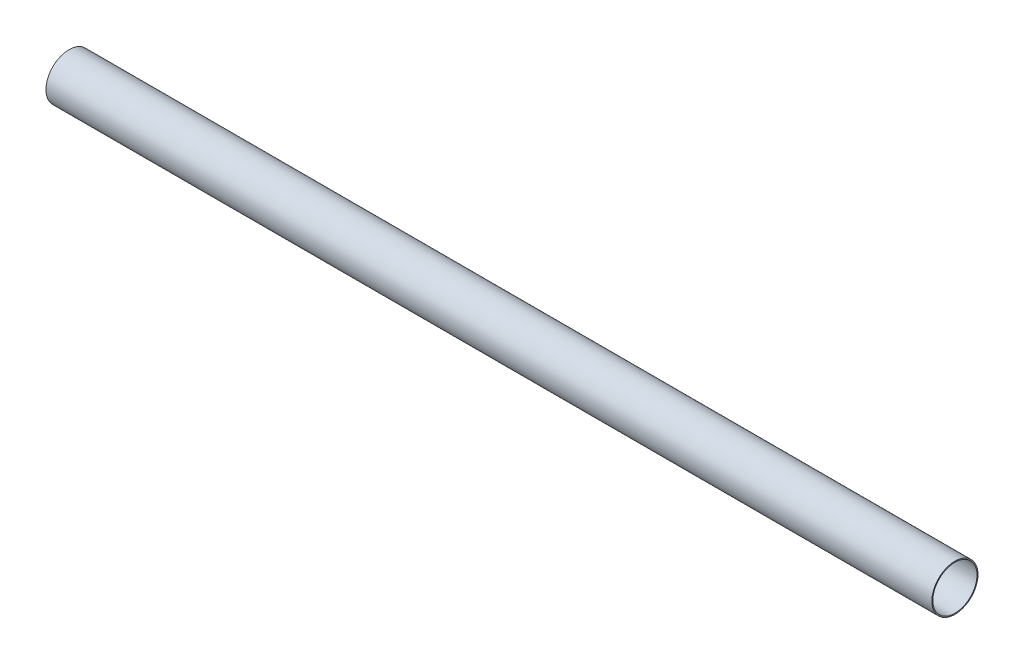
from build123d import *

# Parameters (mm, degrees)
SKETCH1_R           = 45
SKETCH1_R_2         = 43
BOSS_EXTRUDE1_DEPTH = 1728


with BuildPart() as part:
    # Sketch1 → Boss-Extrude1 (new body)
    with BuildSketch(Plane(origin=(0, 0, 0), x_dir=(0, 0, -1), z_dir=(1, 0, 0))):
        Circle(SKETCH1_R)
        Circle(SKETCH1_R_2, mode=Mode.SUBTRACT)
    extrude(amount=-BOSS_EXTRUDE1_DEPTH)


solid = part.part
